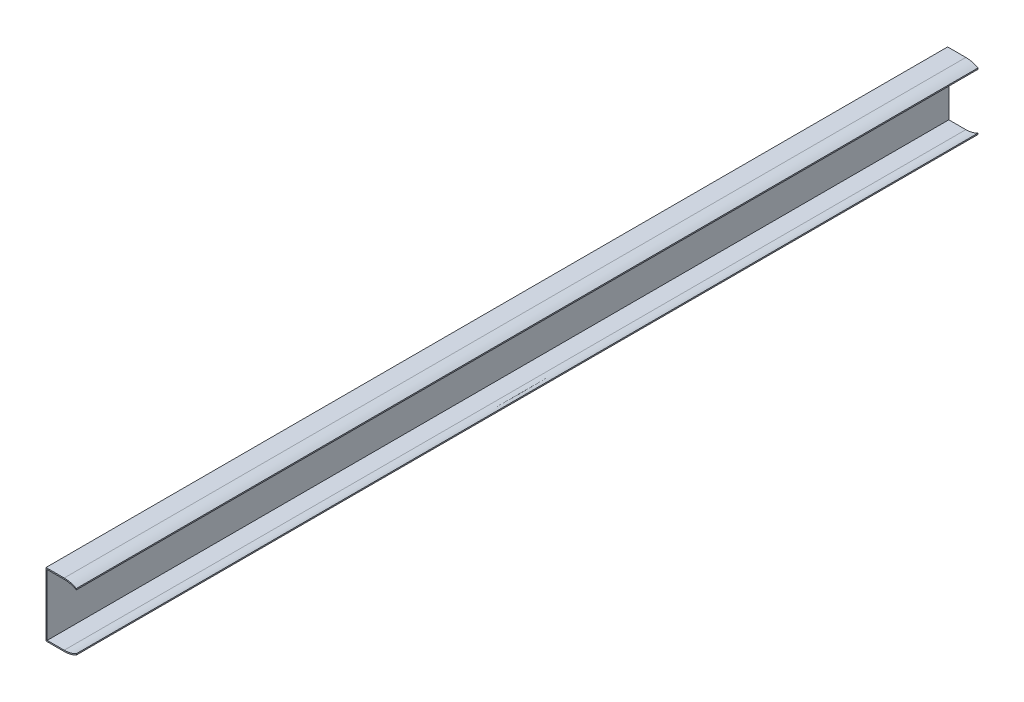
ISO-10303-21;
HEADER;
FILE_DESCRIPTION(('STEP AP214'),'2;1');
FILE_NAME('part.step','',(''),(''),'','','');
FILE_SCHEMA(('AUTOMOTIVE_DESIGN { 1 0 10303 214 1 1 1 1 }'));
ENDSEC;
DATA;
#1=APPLICATION_CONTEXT('core data for automotive mechanical design processes');
#2=APPLICATION_PROTOCOL_DEFINITION('international standard','automotive_design',2000,#1);
#3=PRODUCT_CONTEXT('',#1,'mechanical');
#4=PRODUCT('Part','Part','',(#3));
#5=PRODUCT_RELATED_PRODUCT_CATEGORY('part','',(#4));
#6=PRODUCT_DEFINITION_FORMATION('','',#4);
#7=PRODUCT_DEFINITION_CONTEXT('part definition',#1,'design');
#8=PRODUCT_DEFINITION('design','',#6,#7);
#9=PRODUCT_DEFINITION_SHAPE('','',#8);
#10=(LENGTH_UNIT() NAMED_UNIT(*) SI_UNIT(.MILLI.,.METRE.));
#11=(NAMED_UNIT(*) PLANE_ANGLE_UNIT() SI_UNIT($,.RADIAN.));
#12=(NAMED_UNIT(*) SI_UNIT($,.STERADIAN.) SOLID_ANGLE_UNIT());
#13=UNCERTAINTY_MEASURE_WITH_UNIT(LENGTH_MEASURE(1.E-05),#10,'distance_accuracy_value','');
#14=(GEOMETRIC_REPRESENTATION_CONTEXT(3) GLOBAL_UNCERTAINTY_ASSIGNED_CONTEXT((#13)) GLOBAL_UNIT_ASSIGNED_CONTEXT((#10,
#11,#12)) REPRESENTATION_CONTEXT('',''));
#15=CARTESIAN_POINT('',(0.,0.,0.));
#16=DIRECTION('',(0.,0.,1.));
#17=DIRECTION('',(1.,0.,0.));
#18=AXIS2_PLACEMENT_3D('',#15,#16,#17);
#19=CARTESIAN_POINT('',(0.,0.,1485.));
#20=DIRECTION('',(0.,1.,0.));
#21=DIRECTION('',(0.,0.,1.));
#22=AXIS2_PLACEMENT_3D('',#19,#20,#21);
#23=PLANE('',#22);
#24=DIRECTION('',(1.,0.,0.));
#25=VECTOR('',#24,1.);
#26=CARTESIAN_POINT('',(0.,0.,0.));
#27=LINE('',#26,#25);
#28=CARTESIAN_POINT('',(0.,0.,0.));
#29=VERTEX_POINT('',#28);
#30=CARTESIAN_POINT('',(30.,0.,0.));
#31=VERTEX_POINT('',#30);
#32=EDGE_CURVE('E155',#29,#31,#27,.T.);
#33=ORIENTED_EDGE('',*,*,#32,.T.);
#34=DIRECTION('',(0.,0.,-1.));
#35=VECTOR('',#34,1.);
#36=CARTESIAN_POINT('',(30.,0.,1485.));
#37=LINE('',#36,#35);
#38=CARTESIAN_POINT('',(30.,0.,1485.));
#39=VERTEX_POINT('',#38);
#40=EDGE_CURVE('E11',#39,#31,#37,.T.);
#41=ORIENTED_EDGE('',*,*,#40,.F.);
#42=DIRECTION('',(1.,0.,0.));
#43=VECTOR('',#42,1.);
#44=CARTESIAN_POINT('',(0.,0.,1485.));
#45=LINE('',#44,#43);
#46=CARTESIAN_POINT('',(0.,0.,1485.));
#47=VERTEX_POINT('',#46);
#48=EDGE_CURVE('E197',#47,#39,#45,.T.);
#49=ORIENTED_EDGE('',*,*,#48,.F.);
#50=DIRECTION('',(0.,0.,-1.));
#51=VECTOR('',#50,1.);
#52=CARTESIAN_POINT('',(0.,0.,1485.));
#53=LINE('',#52,#51);
#54=EDGE_CURVE('E148',#47,#29,#53,.T.);
#55=ORIENTED_EDGE('',*,*,#54,.T.);
#56=EDGE_LOOP('',(#33,#41,#49,#55));
#57=FACE_BOUND('',#56,.T.);
#58=ADVANCED_FACE('F32',(#57),#23,.F.);
#59=CARTESIAN_POINT('',(30.,0.,1485.));
#60=CARTESIAN_POINT('',(40.6032812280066,0.0484567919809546,1485.));
#61=CARTESIAN_POINT('',(50.,5.,1485.));
#62=B_SPLINE_CURVE_WITH_KNOTS('',2,(#59,#60,#61),.UNSPECIFIED.,.F.,.F.,(3,3),(0.,1.),.UNSPECIFIED.);
#63=DIRECTION('',(0.,0.,-1.));
#64=VECTOR('',#63,1.);
#65=SURFACE_OF_LINEAR_EXTRUSION('',#62,#64);
#66=CARTESIAN_POINT('',(30.,0.,0.));
#67=CARTESIAN_POINT('',(40.6032812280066,0.0484567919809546,0.));
#68=CARTESIAN_POINT('',(50.,5.,0.));
#69=B_SPLINE_CURVE_WITH_KNOTS('',2,(#66,#67,#68),.UNSPECIFIED.,.F.,.F.,(3,3),(0.,1.),.UNSPECIFIED.);
#70=CARTESIAN_POINT('',(50.,5.,0.));
#71=VERTEX_POINT('',#70);
#72=EDGE_CURVE('E158',#31,#71,#69,.T.);
#73=ORIENTED_EDGE('',*,*,#72,.T.);
#74=DIRECTION('',(0.,0.,-1.));
#75=VECTOR('',#74,1.);
#76=CARTESIAN_POINT('',(50.,5.,1485.));
#77=LINE('',#76,#75);
#78=CARTESIAN_POINT('',(50.,5.,1485.));
#79=VERTEX_POINT('',#78);
#80=EDGE_CURVE('E40',#79,#71,#77,.T.);
#81=ORIENTED_EDGE('',*,*,#80,.F.);
#82=EDGE_CURVE('E103',#39,#79,#62,.T.);
#83=ORIENTED_EDGE('',*,*,#82,.F.);
#84=ORIENTED_EDGE('',*,*,#40,.T.);
#85=EDGE_LOOP('',(#73,#81,#83,#84));
#86=FACE_BOUND('',#85,.T.);
#87=ADVANCED_FACE('F281',(#86),#65,.F.);
#88=CARTESIAN_POINT('',(50.,5.,1485.));
#89=DIRECTION('',(-1.,0.,0.));
#90=DIRECTION('',(0.,0.,1.));
#91=AXIS2_PLACEMENT_3D('',#88,#89,#90);
#92=PLANE('',#91);
#93=DIRECTION('',(0.,1.,0.));
#94=VECTOR('',#93,1.);
#95=CARTESIAN_POINT('',(50.,5.,0.));
#96=LINE('',#95,#94);
#97=CARTESIAN_POINT('',(50.,7.00000000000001,0.));
#98=VERTEX_POINT('',#97);
#99=EDGE_CURVE('E162',#71,#98,#96,.T.);
#100=ORIENTED_EDGE('',*,*,#99,.T.);
#101=DIRECTION('',(0.,0.,-1.));
#102=VECTOR('',#101,1.);
#103=CARTESIAN_POINT('',(50.,7.00000000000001,1485.));
#104=LINE('',#103,#102);
#105=CARTESIAN_POINT('',(50.,7.00000000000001,1485.));
#106=VERTEX_POINT('',#105);
#107=EDGE_CURVE('E216',#106,#98,#104,.T.);
#108=ORIENTED_EDGE('',*,*,#107,.F.);
#109=DIRECTION('',(0.,1.,0.));
#110=VECTOR('',#109,1.);
#111=CARTESIAN_POINT('',(50.,5.,1485.));
#112=LINE('',#111,#110);
#113=EDGE_CURVE('E224',#79,#106,#112,.T.);
#114=ORIENTED_EDGE('',*,*,#113,.F.);
#115=ORIENTED_EDGE('',*,*,#80,.T.);
#116=EDGE_LOOP('',(#100,#108,#114,#115));
#117=FACE_BOUND('',#116,.T.);
#118=ADVANCED_FACE('F222',(#117),#92,.F.);
#119=CARTESIAN_POINT('',(50.,7.00000000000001,1485.));
#120=CARTESIAN_POINT('',(40.6032812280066,2.04845679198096,1485.));
#121=CARTESIAN_POINT('',(30.,2.,1485.));
#122=B_SPLINE_CURVE_WITH_KNOTS('',2,(#119,#120,#121),.UNSPECIFIED.,.F.,.F.,(3,3),(0.,1.),.UNSPECIFIED.);
#123=DIRECTION('',(0.,0.,-1.));
#124=VECTOR('',#123,1.);
#125=SURFACE_OF_LINEAR_EXTRUSION('',#122,#124);
#126=CARTESIAN_POINT('',(50.,7.00000000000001,0.));
#127=CARTESIAN_POINT('',(40.6032812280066,2.04845679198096,0.));
#128=CARTESIAN_POINT('',(30.,2.,0.));
#129=B_SPLINE_CURVE_WITH_KNOTS('',2,(#126,#127,#128),.UNSPECIFIED.,.F.,.F.,(3,3),(0.,1.),.UNSPECIFIED.);
#130=CARTESIAN_POINT('',(30.,2.,0.));
#131=VERTEX_POINT('',#130);
#132=EDGE_CURVE('E167',#98,#131,#129,.T.);
#133=ORIENTED_EDGE('',*,*,#132,.T.);
#134=DIRECTION('',(0.,0.,-1.));
#135=VECTOR('',#134,1.);
#136=CARTESIAN_POINT('',(30.,2.,1485.));
#137=LINE('',#136,#135);
#138=CARTESIAN_POINT('',(30.,2.,1485.));
#139=VERTEX_POINT('',#138);
#140=EDGE_CURVE('E213',#139,#131,#137,.T.);
#141=ORIENTED_EDGE('',*,*,#140,.F.);
#142=EDGE_CURVE('E242',#106,#139,#122,.T.);
#143=ORIENTED_EDGE('',*,*,#142,.F.);
#144=ORIENTED_EDGE('',*,*,#107,.T.);
#145=EDGE_LOOP('',(#133,#141,#143,#144));
#146=FACE_BOUND('',#145,.T.);
#147=ADVANCED_FACE('F233',(#146),#125,.F.);
#148=CARTESIAN_POINT('',(2.,2.,1485.));
#149=DIRECTION('',(0.,-1.,0.));
#150=DIRECTION('',(0.,0.,-1.));
#151=AXIS2_PLACEMENT_3D('',#148,#149,#150);
#152=PLANE('',#151);
#153=DIRECTION('',(-1.,0.,0.));
#154=VECTOR('',#153,1.);
#155=CARTESIAN_POINT('',(2.,2.,0.));
#156=LINE('',#155,#154);
#157=CARTESIAN_POINT('',(2.,2.,0.));
#158=VERTEX_POINT('',#157);
#159=EDGE_CURVE('E171',#131,#158,#156,.T.);
#160=ORIENTED_EDGE('',*,*,#159,.T.);
#161=DIRECTION('',(0.,0.,-1.));
#162=VECTOR('',#161,1.);
#163=CARTESIAN_POINT('',(2.,2.,1485.));
#164=LINE('',#163,#162);
#165=CARTESIAN_POINT('',(2.,2.,1485.));
#166=VERTEX_POINT('',#165);
#167=EDGE_CURVE('E210',#166,#158,#164,.T.);
#168=ORIENTED_EDGE('',*,*,#167,.F.);
#169=DIRECTION('',(-1.,0.,0.));
#170=VECTOR('',#169,1.);
#171=CARTESIAN_POINT('',(2.,2.,1485.));
#172=LINE('',#171,#170);
#173=EDGE_CURVE('E239',#139,#166,#172,.T.);
#174=ORIENTED_EDGE('',*,*,#173,.F.);
#175=ORIENTED_EDGE('',*,*,#140,.T.);
#176=EDGE_LOOP('',(#160,#168,#174,#175));
#177=FACE_BOUND('',#176,.T.);
#178=ADVANCED_FACE('F237',(#177),#152,.F.);
#179=CARTESIAN_POINT('',(2.00000000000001,103.,1485.));
#180=DIRECTION('',(-1.,0.,0.));
#181=DIRECTION('',(0.,-1.,0.));
#182=AXIS2_PLACEMENT_3D('',#179,#180,#181);
#183=PLANE('',#182);
#184=DIRECTION('',(0.,1.,0.));
#185=VECTOR('',#184,1.);
#186=CARTESIAN_POINT('',(2.00000000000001,103.,0.));
#187=LINE('',#186,#185);
#188=CARTESIAN_POINT('',(2.00000000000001,103.,0.));
#189=VERTEX_POINT('',#188);
#190=EDGE_CURVE('E176',#158,#189,#187,.T.);
#191=ORIENTED_EDGE('',*,*,#190,.T.);
#192=DIRECTION('',(0.,0.,-1.));
#193=VECTOR('',#192,1.);
#194=CARTESIAN_POINT('',(2.00000000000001,103.,1485.));
#195=LINE('',#194,#193);
#196=CARTESIAN_POINT('',(2.00000000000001,103.,1485.));
#197=VERTEX_POINT('',#196);
#198=EDGE_CURVE('E207',#197,#189,#195,.T.);
#199=ORIENTED_EDGE('',*,*,#198,.F.);
#200=DIRECTION('',(0.,1.,0.));
#201=VECTOR('',#200,1.);
#202=CARTESIAN_POINT('',(2.00000000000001,103.,1485.));
#203=LINE('',#202,#201);
#204=EDGE_CURVE('E241',#166,#197,#203,.T.);
#205=ORIENTED_EDGE('',*,*,#204,.F.);
#206=ORIENTED_EDGE('',*,*,#167,.T.);
#207=EDGE_LOOP('',(#191,#199,#205,#206));
#208=FACE_BOUND('',#207,.T.);
#209=ADVANCED_FACE('F271',(#208),#183,.F.);
#210=CARTESIAN_POINT('',(2.00000000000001,103.,1485.));
#211=DIRECTION('',(0.,1.,0.));
#212=DIRECTION('',(0.,0.,1.));
#213=AXIS2_PLACEMENT_3D('',#210,#211,#212);
#214=PLANE('',#213);
#215=DIRECTION('',(1.,0.,0.));
#216=VECTOR('',#215,1.);
#217=CARTESIAN_POINT('',(2.00000000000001,103.,0.));
#218=LINE('',#217,#216);
#219=CARTESIAN_POINT('',(30.,103.,0.));
#220=VERTEX_POINT('',#219);
#221=EDGE_CURVE('E178',#189,#220,#218,.T.);
#222=ORIENTED_EDGE('',*,*,#221,.T.);
#223=DIRECTION('',(0.,0.,-1.));
#224=VECTOR('',#223,1.);
#225=CARTESIAN_POINT('',(30.,103.,1485.));
#226=LINE('',#225,#224);
#227=CARTESIAN_POINT('',(30.,103.,1485.));
#228=VERTEX_POINT('',#227);
#229=EDGE_CURVE('E204',#228,#220,#226,.T.);
#230=ORIENTED_EDGE('',*,*,#229,.F.);
#231=DIRECTION('',(1.,0.,0.));
#232=VECTOR('',#231,1.);
#233=CARTESIAN_POINT('',(2.00000000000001,103.,1485.));
#234=LINE('',#233,#232);
#235=EDGE_CURVE('E244',#197,#228,#234,.T.);
#236=ORIENTED_EDGE('',*,*,#235,.F.);
#237=ORIENTED_EDGE('',*,*,#198,.T.);
#238=EDGE_LOOP('',(#222,#230,#236,#237));
#239=FACE_BOUND('',#238,.T.);
#240=ADVANCED_FACE('F266',(#239),#214,.F.);
#241=CARTESIAN_POINT('',(30.,103.,1485.));
#242=CARTESIAN_POINT('',(40.6032812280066,102.951543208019,1485.));
#243=CARTESIAN_POINT('',(50.,98.,1485.));
#244=B_SPLINE_CURVE_WITH_KNOTS('',2,(#241,#242,#243),.UNSPECIFIED.,.F.,.F.,(3,3),(0.,1.),.UNSPECIFIED.);
#245=DIRECTION('',(0.,0.,-1.));
#246=VECTOR('',#245,1.);
#247=SURFACE_OF_LINEAR_EXTRUSION('',#244,#246);
#248=CARTESIAN_POINT('',(30.,103.,0.));
#249=CARTESIAN_POINT('',(40.6032812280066,102.951543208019,0.));
#250=CARTESIAN_POINT('',(50.,98.,0.));
#251=B_SPLINE_CURVE_WITH_KNOTS('',2,(#248,#249,#250),.UNSPECIFIED.,.F.,.F.,(3,3),(0.,1.),.UNSPECIFIED.);
#252=CARTESIAN_POINT('',(50.,98.,0.));
#253=VERTEX_POINT('',#252);
#254=EDGE_CURVE('E180',#220,#253,#251,.T.);
#255=ORIENTED_EDGE('',*,*,#254,.T.);
#256=DIRECTION('',(0.,0.,-1.));
#257=VECTOR('',#256,1.);
#258=CARTESIAN_POINT('',(50.,98.,1485.));
#259=LINE('',#258,#257);
#260=CARTESIAN_POINT('',(50.,98.,1485.));
#261=VERTEX_POINT('',#260);
#262=EDGE_CURVE('E201',#261,#253,#259,.T.);
#263=ORIENTED_EDGE('',*,*,#262,.F.);
#264=EDGE_CURVE('E253',#228,#261,#244,.T.);
#265=ORIENTED_EDGE('',*,*,#264,.F.);
#266=ORIENTED_EDGE('',*,*,#229,.T.);
#267=EDGE_LOOP('',(#255,#263,#265,#266));
#268=FACE_BOUND('',#267,.T.);
#269=ADVANCED_FACE('F261',(#268),#247,.F.);
#270=CARTESIAN_POINT('',(50.,100.,1485.));
#271=DIRECTION('',(-1.,0.,0.));
#272=DIRECTION('',(0.,0.,1.));
#273=AXIS2_PLACEMENT_3D('',#270,#271,#272);
#274=PLANE('',#273);
#275=DIRECTION('',(0.,1.,0.));
#276=VECTOR('',#275,1.);
#277=CARTESIAN_POINT('',(50.,100.,0.));
#278=LINE('',#277,#276);
#279=CARTESIAN_POINT('',(50.,100.,0.));
#280=VERTEX_POINT('',#279);
#281=EDGE_CURVE('E184',#253,#280,#278,.T.);
#282=ORIENTED_EDGE('',*,*,#281,.T.);
#283=DIRECTION('',(0.,0.,-1.));
#284=VECTOR('',#283,1.);
#285=CARTESIAN_POINT('',(50.,100.,1485.));
#286=LINE('',#285,#284);
#287=CARTESIAN_POINT('',(50.,100.,1485.));
#288=VERTEX_POINT('',#287);
#289=EDGE_CURVE('E143',#288,#280,#286,.T.);
#290=ORIENTED_EDGE('',*,*,#289,.F.);
#291=DIRECTION('',(0.,1.,0.));
#292=VECTOR('',#291,1.);
#293=CARTESIAN_POINT('',(50.,100.,1485.));
#294=LINE('',#293,#292);
#295=EDGE_CURVE('E134',#261,#288,#294,.T.);
#296=ORIENTED_EDGE('',*,*,#295,.F.);
#297=ORIENTED_EDGE('',*,*,#262,.T.);
#298=EDGE_LOOP('',(#282,#290,#296,#297));
#299=FACE_BOUND('',#298,.T.);
#300=ADVANCED_FACE('F265',(#299),#274,.F.);
#301=CARTESIAN_POINT('',(50.,100.,1485.));
#302=CARTESIAN_POINT('',(40.6032812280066,104.951543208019,1485.));
#303=CARTESIAN_POINT('',(30.,105.,1485.));
#304=B_SPLINE_CURVE_WITH_KNOTS('',2,(#301,#302,#303),.UNSPECIFIED.,.F.,.F.,(3,3),(0.,1.),.UNSPECIFIED.);
#305=DIRECTION('',(0.,0.,-1.));
#306=VECTOR('',#305,1.);
#307=SURFACE_OF_LINEAR_EXTRUSION('',#304,#306);
#308=CARTESIAN_POINT('',(50.,100.,0.));
#309=CARTESIAN_POINT('',(40.6032812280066,104.951543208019,0.));
#310=CARTESIAN_POINT('',(30.,105.,0.));
#311=B_SPLINE_CURVE_WITH_KNOTS('',2,(#308,#309,#310),.UNSPECIFIED.,.F.,.F.,(3,3),(0.,1.),.UNSPECIFIED.);
#312=CARTESIAN_POINT('',(30.,105.,0.));
#313=VERTEX_POINT('',#312);
#314=EDGE_CURVE('E142',#280,#313,#311,.T.);
#315=ORIENTED_EDGE('',*,*,#314,.T.);
#316=DIRECTION('',(0.,0.,-1.));
#317=VECTOR('',#316,1.);
#318=CARTESIAN_POINT('',(30.,105.,1485.));
#319=LINE('',#318,#317);
#320=CARTESIAN_POINT('',(30.,105.,1485.));
#321=VERTEX_POINT('',#320);
#322=EDGE_CURVE('E139',#321,#313,#319,.T.);
#323=ORIENTED_EDGE('',*,*,#322,.F.);
#324=EDGE_CURVE('E128',#288,#321,#304,.T.);
#325=ORIENTED_EDGE('',*,*,#324,.F.);
#326=ORIENTED_EDGE('',*,*,#289,.T.);
#327=EDGE_LOOP('',(#315,#323,#325,#326));
#328=FACE_BOUND('',#327,.T.);
#329=ADVANCED_FACE('F140',(#328),#307,.F.);
#330=CARTESIAN_POINT('',(0.,105.,1485.));
#331=DIRECTION('',(0.,-1.,0.));
#332=DIRECTION('',(0.,0.,-1.));
#333=AXIS2_PLACEMENT_3D('',#330,#331,#332);
#334=PLANE('',#333);
#335=DIRECTION('',(-1.,0.,0.));
#336=VECTOR('',#335,1.);
#337=CARTESIAN_POINT('',(0.,105.,0.));
#338=LINE('',#337,#336);
#339=CARTESIAN_POINT('',(0.,105.,0.));
#340=VERTEX_POINT('',#339);
#341=EDGE_CURVE('E89',#313,#340,#338,.T.);
#342=ORIENTED_EDGE('',*,*,#341,.T.);
#343=DIRECTION('',(0.,0.,-1.));
#344=VECTOR('',#343,1.);
#345=CARTESIAN_POINT('',(0.,105.,1485.));
#346=LINE('',#345,#344);
#347=CARTESIAN_POINT('',(0.,105.,1485.));
#348=VERTEX_POINT('',#347);
#349=EDGE_CURVE('E144',#348,#340,#346,.T.);
#350=ORIENTED_EDGE('',*,*,#349,.F.);
#351=DIRECTION('',(-1.,0.,0.));
#352=VECTOR('',#351,1.);
#353=CARTESIAN_POINT('',(0.,105.,1485.));
#354=LINE('',#353,#352);
#355=EDGE_CURVE('E132',#321,#348,#354,.T.);
#356=ORIENTED_EDGE('',*,*,#355,.F.);
#357=ORIENTED_EDGE('',*,*,#322,.T.);
#358=EDGE_LOOP('',(#342,#350,#356,#357));
#359=FACE_BOUND('',#358,.T.);
#360=ADVANCED_FACE('F146',(#359),#334,.F.);
#361=CARTESIAN_POINT('',(0.,0.,1485.));
#362=DIRECTION('',(1.,0.,0.));
#363=DIRECTION('',(0.,0.,-1.));
#364=AXIS2_PLACEMENT_3D('',#361,#362,#363);
#365=PLANE('',#364);
#366=DIRECTION('',(0.,-1.,0.));
#367=VECTOR('',#366,1.);
#368=CARTESIAN_POINT('',(0.,0.,0.));
#369=LINE('',#368,#367);
#370=EDGE_CURVE('E95',#340,#29,#369,.T.);
#371=ORIENTED_EDGE('',*,*,#370,.T.);
#372=ORIENTED_EDGE('',*,*,#54,.F.);
#373=DIRECTION('',(0.,-1.,0.));
#374=VECTOR('',#373,1.);
#375=CARTESIAN_POINT('',(0.,0.,1485.));
#376=LINE('',#375,#374);
#377=EDGE_CURVE('E48',#348,#47,#376,.T.);
#378=ORIENTED_EDGE('',*,*,#377,.F.);
#379=ORIENTED_EDGE('',*,*,#349,.T.);
#380=EDGE_LOOP('',(#371,#372,#378,#379));
#381=FACE_BOUND('',#380,.T.);
#382=ADVANCED_FACE('F357',(#381),#365,.F.);
#383=CARTESIAN_POINT('',(40.3016406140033,1.27422839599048,1485.));
#384=DIRECTION('',(0.,0.,-1.));
#385=DIRECTION('',(-1.,0.,0.));
#386=AXIS2_PLACEMENT_3D('',#383,#384,#385);
#387=PLANE('',#386);
#388=ORIENTED_EDGE('',*,*,#48,.T.);
#389=ORIENTED_EDGE('',*,*,#82,.T.);
#390=ORIENTED_EDGE('',*,*,#113,.T.);
#391=ORIENTED_EDGE('',*,*,#142,.T.);
#392=ORIENTED_EDGE('',*,*,#173,.T.);
#393=ORIENTED_EDGE('',*,*,#204,.T.);
#394=ORIENTED_EDGE('',*,*,#235,.T.);
#395=ORIENTED_EDGE('',*,*,#264,.T.);
#396=ORIENTED_EDGE('',*,*,#295,.T.);
#397=ORIENTED_EDGE('',*,*,#324,.T.);
#398=ORIENTED_EDGE('',*,*,#355,.T.);
#399=ORIENTED_EDGE('',*,*,#377,.T.);
#400=EDGE_LOOP('',(#388,#389,#390,#391,#392,#393,#394,#395,#396,#397,#398,#399));
#401=FACE_BOUND('',#400,.T.);
#402=ADVANCED_FACE('F130',(#401),#387,.F.);
#403=CARTESIAN_POINT('',(40.3016406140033,1.27422839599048,0.));
#404=DIRECTION('',(0.,0.,-1.));
#405=DIRECTION('',(-1.,0.,0.));
#406=AXIS2_PLACEMENT_3D('',#403,#404,#405);
#407=PLANE('',#406);
#408=ORIENTED_EDGE('',*,*,#32,.F.);
#409=ORIENTED_EDGE('',*,*,#370,.F.);
#410=ORIENTED_EDGE('',*,*,#341,.F.);
#411=ORIENTED_EDGE('',*,*,#314,.F.);
#412=ORIENTED_EDGE('',*,*,#281,.F.);
#413=ORIENTED_EDGE('',*,*,#254,.F.);
#414=ORIENTED_EDGE('',*,*,#221,.F.);
#415=ORIENTED_EDGE('',*,*,#190,.F.);
#416=ORIENTED_EDGE('',*,*,#159,.F.);
#417=ORIENTED_EDGE('',*,*,#132,.F.);
#418=ORIENTED_EDGE('',*,*,#99,.F.);
#419=ORIENTED_EDGE('',*,*,#72,.F.);
#420=EDGE_LOOP('',(#408,#409,#410,#411,#412,#413,#414,#415,#416,#417,#418,#419));
#421=FACE_BOUND('',#420,.T.);
#422=ADVANCED_FACE('F228',(#421),#407,.T.);
#423=CLOSED_SHELL('',(#58,#87,#118,#147,#178,#209,#240,#269,#300,#329,#360,#382,#402,#422));
#424=MANIFOLD_SOLID_BREP('B2',#423);
#425=ADVANCED_BREP_SHAPE_REPRESENTATION('',(#18,#424),#14);
#426=SHAPE_DEFINITION_REPRESENTATION(#9,#425);
ENDSEC;
END-ISO-10303-21;
